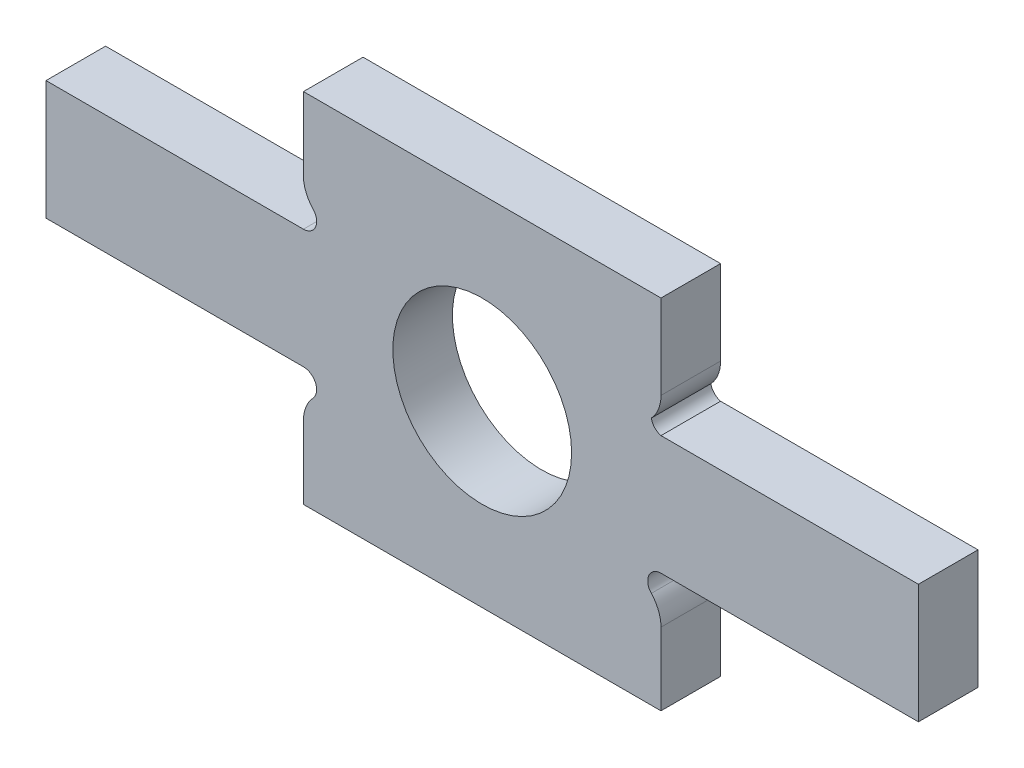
from build123d import *

# Parameters (mm, degrees)
BOSS_EXTRU_1_DEPTH      = 10
ESQUISSE2_R             = 15
ENL_V_MAT_EXTRU_1_DEPTH = 10


with BuildPart() as part:
    # Esquisse1 → Boss.-Extru.1 (new body)
    with BuildSketch(Plane.XY):
        with BuildLine():
            Line((30, -10), (73.2, -10))
            Line((73.2, -10), (73.2, 10))
            Line((73.2, 10), (30, 10))
            ThreePointArc((30, 10), (28.937806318, 10.633704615), (28.379562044, 11.737425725))
            ThreePointArc((28.379562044, 11.737425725), (29.580204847, 13.633737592), (30, 15.838576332))
            Line((30, 15.838576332), (30, 30))
            Line((30, 30), (-30, 30))
            Line((-30, 30), (-30, 17.374003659))
            ThreePointArc((-30, 17.374003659), (-29.50020143, 15.417393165), (-28.379562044, 13.737425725))
            ThreePointArc((-28.379562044, 13.737425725), (-27.963202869, 11.336904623), (-30, 10))
            Line((-30, 10), (-73.2, 10))
            Line((-73.2, 10), (-73.2, -10))
            Line((-73.2, -10), (-30, -10))
            ThreePointArc((-30, -10), (-27.963202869, -11.336904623), (-28.379562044, -13.737425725))
            ThreePointArc((-28.379562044, -13.737425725), (-29.580204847, -15.633737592), (-30, -17.838576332))
            Line((-30, -17.838576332), (-30, -30))
            Line((-30, -30), (30, -30))
            Line((30, -30), (30, -17.838576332))
            ThreePointArc((30, -17.838576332), (29.580204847, -15.633737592), (28.379562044, -13.737425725))
            ThreePointArc((28.379562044, -13.737425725), (27.963202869, -11.336904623), (30, -10))
        make_face()
    extrude(amount=BOSS_EXTRU_1_DEPTH)

    # Esquisse2 → Enl_v. mat.-Extru.1 (cut)
    with BuildSketch(Plane.XY.offset(10)):
        Circle(ESQUISSE2_R)
    extrude(amount=-ENL_V_MAT_EXTRU_1_DEPTH, mode=Mode.SUBTRACT)


solid = part.part
